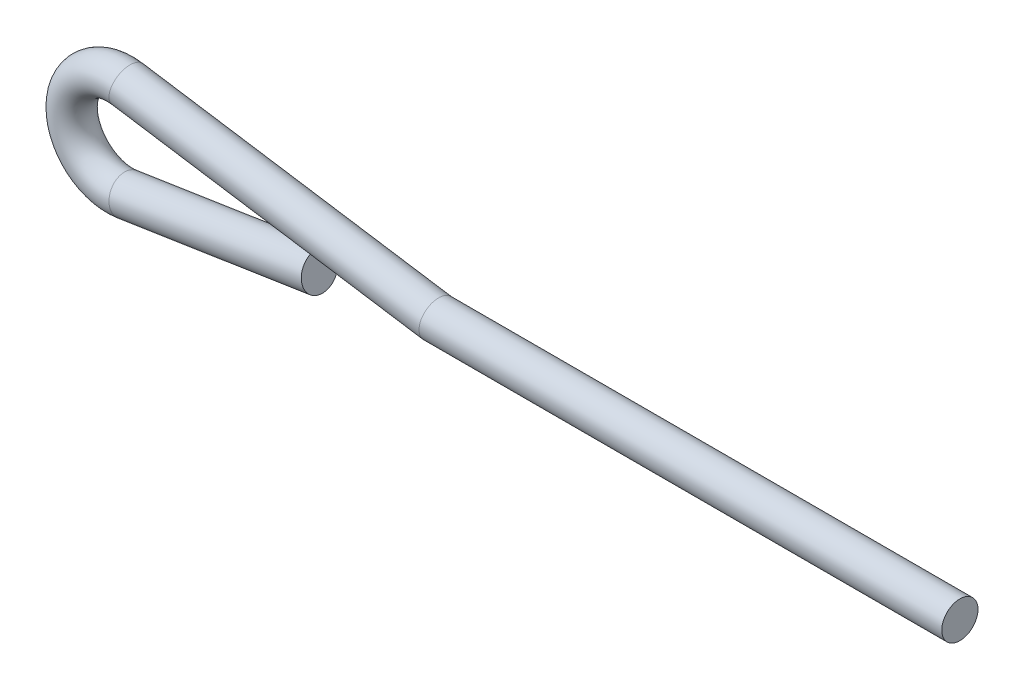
from build123d import *

# Parameters (mm, degrees)
SKETCH1_R = 6


with BuildPart() as part:
    # BaseBody: sweep along a path in Sketch2
    with BuildLine(Plane(origin=(-83.695566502, -114.538423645, 0), x_dir=(0, 1, 0), z_dir=(0, 0, 1))) as basebody_path:
        Line((114.538423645, -361.695566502), (114.538423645, -188.695566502))
        Line((114.538423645, -188.695566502), (130.351572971, -86.133661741))
        ThreePointArc((130.351572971, -86.133661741), (114.538423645, -67.695566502), (98.725274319, -86.133661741))
        Line((98.725274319, -86.133661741), (108.538423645, -149.780394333))
    # Sketch1 → BaseBody (sweep)
    with BuildSketch(Plane(origin=(66.08482783, -6, 0), x_dir=(0, 0, 1), z_dir=(-0.9883218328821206, -0.1523809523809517, 0))):
        Circle(SKETCH1_R)
    sweep(path=basebody_path.line, transition=Transition.RIGHT)


solid = part.part
